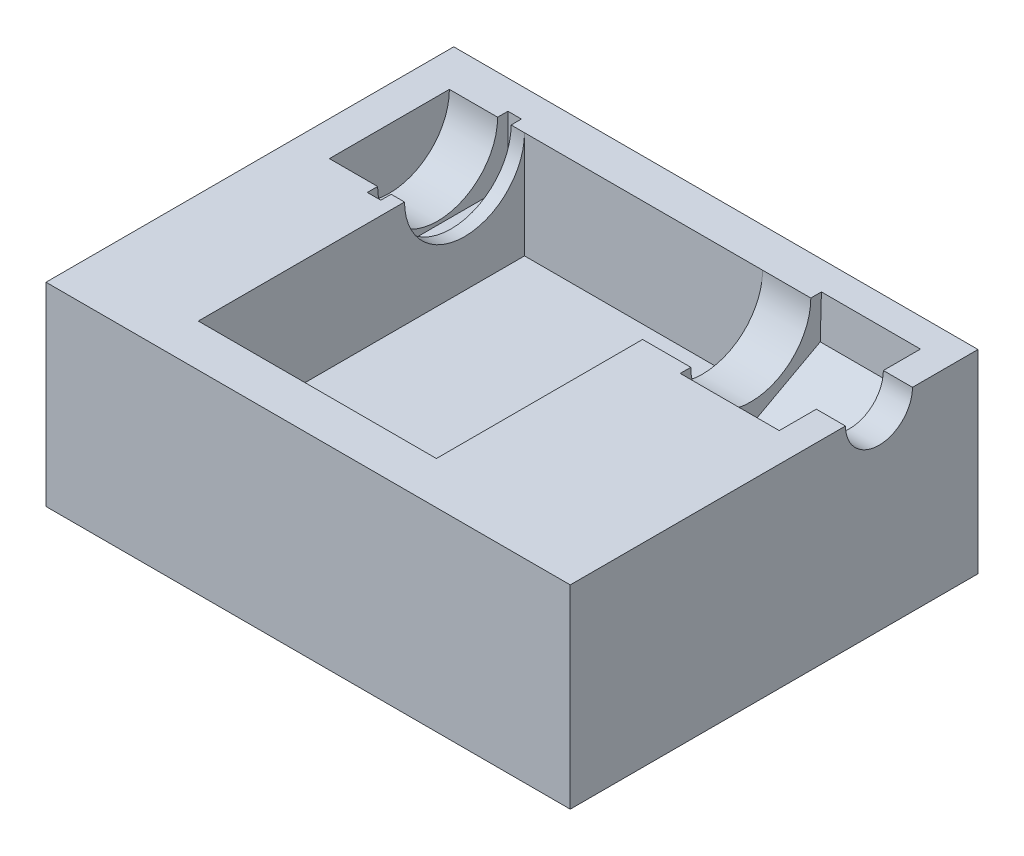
from build123d import *

# Parameters (mm, degrees)
CROQUIS1_W              = 90
CROQUIS1_H              = 70
SALIENTE_EXTRUIR1_DEPTH = 33.35
CROQUIS2_R              = 5.75
CORTAR_EXTRUIR1_DEPTH   = 5
CORTAR_EXTRUIR2_DEPTH   = 17
CROQUIS6_R              = 10.3
CORTAR_EXTRUIR3_DEPTH   = 8.28
CROQUIS8_W              = 40.87
CROQUIS8_H              = 56
CORTAR_EXTRUIR4_DEPTH   = 18.315
CROQUIS13_R             = 10.3
CORTAR_EXTRUIR6_DEPTH   = 2.3
CROQUIS14_W             = 24.14
CROQUIS14_H             = 21.8
CORTAR_EXTRUIR7_DEPTH   = 2.32
CROQUIS15_R             = 10.3
CORTAR_EXTRUIR8_DEPTH   = 8.28


with BuildPart() as part:
    # Croquis1 → Saliente-Extruir1 (new body)
    with BuildSketch(Plane(origin=(0, 0, 0), x_dir=(1, 0, 0), z_dir=(0, 1, 0))):
        Rectangle(CROQUIS1_W, CROQUIS1_H)
    extrude(amount=SALIENTE_EXTRUIR1_DEPTH)

    # Croquis2 → Cortar-Extruir1 (cut)
    with BuildSketch(Plane(origin=(45, 0, 0), x_dir=(0, 0, -1), z_dir=(1, 0, 0))):
        with Locations((18, 33.35)):
            Circle(CROQUIS2_R)
    extrude(amount=-CORTAR_EXTRUIR1_DEPTH, mode=Mode.SUBTRACT)

    # Croquis5 → Cortar-Extruir2 (cut)
    with BuildSketch(Plane(origin=(40, 0, 0), x_dir=(0, 0, -1), z_dir=(1, 0, 0))):
        Polygon((30.304085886, 40.006812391), (18.387074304, 47.334057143), (6.082988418, 40.677244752), (5.695914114, 26.693187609), (17.612925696, 19.365942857), (29.917011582, 26.022755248), align=None)
    extrude(amount=-CORTAR_EXTRUIR2_DEPTH, mode=Mode.SUBTRACT)

    # Croquis6 → Cortar-Extruir3 (cut)
    with BuildSketch(Plane(origin=(23, 0, 0), x_dir=(0, 0, -1), z_dir=(1, 0, 0))):
        with Locations((18, 33.35)):
            Circle(CROQUIS6_R)
    extrude(amount=-CORTAR_EXTRUIR3_DEPTH, mode=Mode.SUBTRACT)

    # Croquis8 → Cortar-Extruir4 (cut)
    with BuildSketch(Plane(origin=(0, 33.35, 0), x_dir=(1, 0, 0), z_dir=(0, 1, 0))):
        with Locations((-5.715, 0.3)):
            Rectangle(CROQUIS8_W, CROQUIS8_H)
    extrude(amount=-CORTAR_EXTRUIR4_DEPTH, mode=Mode.SUBTRACT)

    # Croquis13 → Cortar-Extruir6 (cut)
    with BuildSketch(Plane(origin=(-26.15, 0, 0), x_dir=(0, 0, -1), z_dir=(1, 0, 0))):
        with Locations((18, 33.35)):
            Circle(CROQUIS13_R)
    extrude(amount=-CORTAR_EXTRUIR6_DEPTH, mode=Mode.SUBTRACT)

    # Croquis14 → Cortar-Extruir7 (cut)
    with BuildSketch(Plane(origin=(-28.45, 0, 0), x_dir=(0, 0, -1), z_dir=(1, 0, 0))):
        with Locations((18, 33.35)):
            Rectangle(CROQUIS14_W, CROQUIS14_H)
    extrude(amount=-CORTAR_EXTRUIR7_DEPTH, mode=Mode.SUBTRACT)

    # Croquis15 → Cortar-Extruir8 (cut)
    with BuildSketch(Plane(origin=(-30.77, 0, 0), x_dir=(0, 0, -1), z_dir=(1, 0, 0))):
        with Locations((18, 33.35)):
            Circle(CROQUIS15_R)
    extrude(amount=-CORTAR_EXTRUIR8_DEPTH, mode=Mode.SUBTRACT)


solid = part.part
